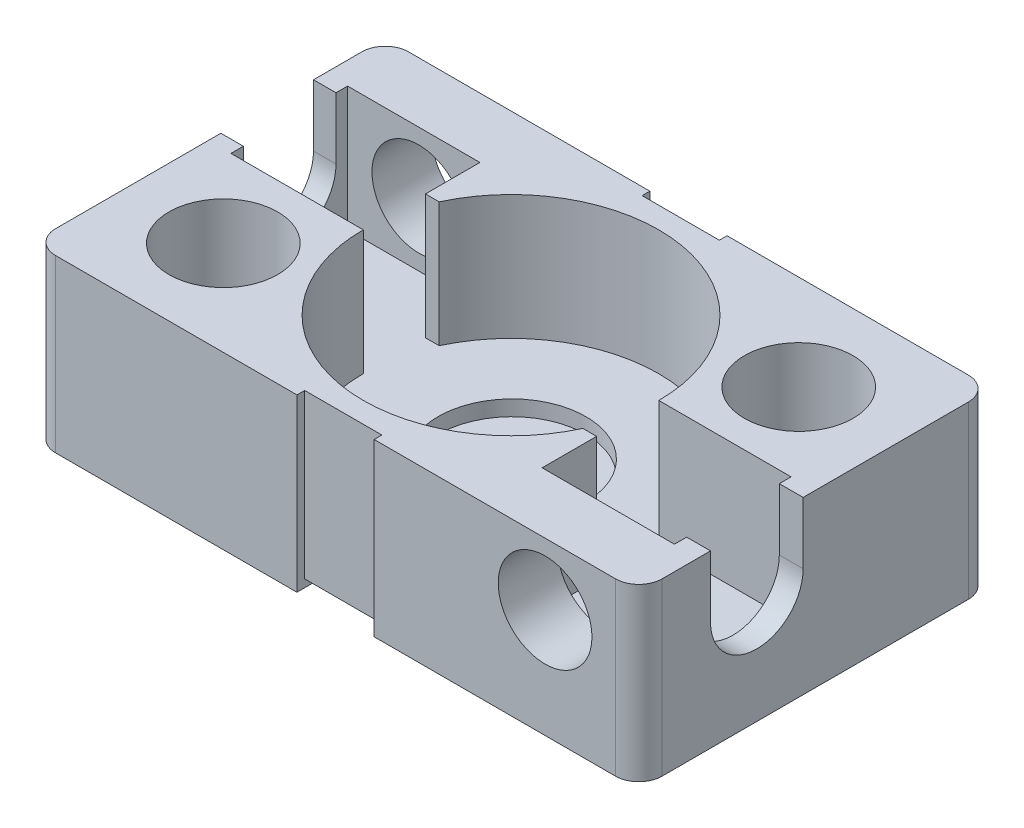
ISO-10303-21;
HEADER;
FILE_DESCRIPTION(('STEP AP214'),'2;1');
FILE_NAME('part.step','',(''),(''),'','','');
FILE_SCHEMA(('AUTOMOTIVE_DESIGN { 1 0 10303 214 1 1 1 1 }'));
ENDSEC;
DATA;
#1=APPLICATION_CONTEXT('core data for automotive mechanical design processes');
#2=APPLICATION_PROTOCOL_DEFINITION('international standard','automotive_design',2000,#1);
#3=PRODUCT_CONTEXT('',#1,'mechanical');
#4=PRODUCT('Part','Part','',(#3));
#5=PRODUCT_RELATED_PRODUCT_CATEGORY('part','',(#4));
#6=PRODUCT_DEFINITION_FORMATION('','',#4);
#7=PRODUCT_DEFINITION_CONTEXT('part definition',#1,'design');
#8=PRODUCT_DEFINITION('design','',#6,#7);
#9=PRODUCT_DEFINITION_SHAPE('','',#8);
#10=(LENGTH_UNIT() NAMED_UNIT(*) SI_UNIT(.MILLI.,.METRE.));
#11=(NAMED_UNIT(*) PLANE_ANGLE_UNIT() SI_UNIT($,.RADIAN.));
#12=(NAMED_UNIT(*) SI_UNIT($,.STERADIAN.) SOLID_ANGLE_UNIT());
#13=UNCERTAINTY_MEASURE_WITH_UNIT(LENGTH_MEASURE(1.E-05),#10,'distance_accuracy_value','');
#14=(GEOMETRIC_REPRESENTATION_CONTEXT(3) GLOBAL_UNCERTAINTY_ASSIGNED_CONTEXT((#13)) GLOBAL_UNIT_ASSIGNED_CONTEXT((#10,
#11,#12)) REPRESENTATION_CONTEXT('',''));
#15=CARTESIAN_POINT('',(0.,0.,0.));
#16=DIRECTION('',(0.,0.,1.));
#17=DIRECTION('',(1.,0.,0.));
#18=AXIS2_PLACEMENT_3D('',#15,#16,#17);
#19=CARTESIAN_POINT('',(-25.39,-15.5,16.));
#20=DIRECTION('',(0.,0.,1.));
#21=DIRECTION('',(1.,0.,0.));
#22=AXIS2_PLACEMENT_3D('',#19,#20,#21);
#23=PLANE('',#22);
#24=DIRECTION('',(0.,1.,0.));
#25=VECTOR('',#24,1.);
#26=CARTESIAN_POINT('',(-3.5,-15.5,16.));
#27=LINE('',#26,#25);
#28=CARTESIAN_POINT('',(-3.5,-15.5,16.));
#29=VERTEX_POINT('',#28);
#30=CARTESIAN_POINT('',(-3.5,0.,16.));
#31=VERTEX_POINT('',#30);
#32=EDGE_CURVE('E439',#29,#31,#27,.T.);
#33=ORIENTED_EDGE('',*,*,#32,.T.);
#34=DIRECTION('',(1.,0.,0.));
#35=VECTOR('',#34,1.);
#36=CARTESIAN_POINT('',(-25.39,0.,16.));
#37=LINE('',#36,#35);
#38=CARTESIAN_POINT('',(-25.39,0.,16.));
#39=VERTEX_POINT('',#38);
#40=EDGE_CURVE('E623',#39,#31,#37,.T.);
#41=ORIENTED_EDGE('',*,*,#40,.F.);
#42=DIRECTION('',(0.,1.,0.));
#43=VECTOR('',#42,1.);
#44=CARTESIAN_POINT('',(-25.39,-15.5,16.));
#45=LINE('',#44,#43);
#46=CARTESIAN_POINT('',(-25.39,-15.5,16.));
#47=VERTEX_POINT('',#46);
#48=EDGE_CURVE('E676',#47,#39,#45,.T.);
#49=ORIENTED_EDGE('',*,*,#48,.F.);
#50=DIRECTION('',(1.,0.,0.));
#51=VECTOR('',#50,1.);
#52=CARTESIAN_POINT('',(-25.39,-15.5,16.));
#53=LINE('',#52,#51);
#54=EDGE_CURVE('E642',#47,#29,#53,.T.);
#55=ORIENTED_EDGE('',*,*,#54,.T.);
#56=EDGE_LOOP('',(#33,#41,#49,#55));
#57=FACE_BOUND('',#56,.T.);
#58=ADVANCED_FACE('F113',(#57),#23,.T.);
#59=CARTESIAN_POINT('',(-25.39,-15.5,-16.));
#60=DIRECTION('',(0.,0.,-1.));
#61=DIRECTION('',(-1.,0.,0.));
#62=AXIS2_PLACEMENT_3D('',#59,#60,#61);
#63=PLANE('',#62);
#64=DIRECTION('',(0.,1.,0.));
#65=VECTOR('',#64,1.);
#66=CARTESIAN_POINT('',(3.5,-15.5,-16.));
#67=LINE('',#66,#65);
#68=CARTESIAN_POINT('',(3.5,-15.5,-16.));
#69=VERTEX_POINT('',#68);
#70=CARTESIAN_POINT('',(3.5,0.,-16.));
#71=VERTEX_POINT('',#70);
#72=EDGE_CURVE('E375',#69,#71,#67,.T.);
#73=ORIENTED_EDGE('',*,*,#72,.T.);
#74=DIRECTION('',(-1.,0.,0.));
#75=VECTOR('',#74,1.);
#76=CARTESIAN_POINT('',(-25.39,0.,-16.));
#77=LINE('',#76,#75);
#78=CARTESIAN_POINT('',(25.39,0.,-16.));
#79=VERTEX_POINT('',#78);
#80=EDGE_CURVE('E656',#79,#71,#77,.T.);
#81=ORIENTED_EDGE('',*,*,#80,.F.);
#82=DIRECTION('',(0.,1.,0.));
#83=VECTOR('',#82,1.);
#84=CARTESIAN_POINT('',(25.39,-15.5,-16.));
#85=LINE('',#84,#83);
#86=CARTESIAN_POINT('',(25.39,-15.5,-16.));
#87=VERTEX_POINT('',#86);
#88=EDGE_CURVE('E686',#87,#79,#85,.T.);
#89=ORIENTED_EDGE('',*,*,#88,.F.);
#90=DIRECTION('',(-1.,0.,0.));
#91=VECTOR('',#90,1.);
#92=CARTESIAN_POINT('',(-25.39,-15.5,-16.));
#93=LINE('',#92,#91);
#94=EDGE_CURVE('E630',#87,#69,#93,.T.);
#95=ORIENTED_EDGE('',*,*,#94,.T.);
#96=EDGE_LOOP('',(#73,#81,#89,#95));
#97=FACE_BOUND('',#96,.T.);
#98=ADVANCED_FACE('F755',(#97),#63,.T.);
#99=CARTESIAN_POINT('',(25.39,0.,13.89));
#100=DIRECTION('',(0.,-1.,0.));
#101=DIRECTION('',(0.,0.,-1.));
#102=AXIS2_PLACEMENT_3D('',#99,#100,#101);
#103=PLANE('',#102);
#104=CARTESIAN_POINT('',(-18.7489875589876,0.,7.42949377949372));
#105=DIRECTION('',(0.,1.,0.));
#106=DIRECTION('',(0.,0.,1.));
#107=AXIS2_PLACEMENT_3D('',#104,#105,#106);
#108=CIRCLE('',#107,4.93);
#109=CARTESIAN_POINT('',(-18.7489875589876,0.,12.3594937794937));
#110=VERTEX_POINT('',#109);
#111=EDGE_CURVE('E506',#110,#110,#108,.T.);
#112=ORIENTED_EDGE('',*,*,#111,.F.);
#113=EDGE_LOOP('',(#112));
#114=FACE_BOUND('',#113,.T.);
#115=ORIENTED_EDGE('',*,*,#40,.T.);
#116=DIRECTION('',(0.,0.,1.));
#117=VECTOR('',#116,1.);
#118=CARTESIAN_POINT('',(-3.5,0.,16.));
#119=LINE('',#118,#117);
#120=CARTESIAN_POINT('',(-3.5,0.,15.3));
#121=VERTEX_POINT('',#120);
#122=EDGE_CURVE('E429',#121,#31,#119,.T.);
#123=ORIENTED_EDGE('',*,*,#122,.F.);
#124=DIRECTION('',(-1.,0.,0.));
#125=VECTOR('',#124,1.);
#126=CARTESIAN_POINT('',(-3.5,0.,15.3));
#127=LINE('',#126,#125);
#128=CARTESIAN_POINT('',(3.5,0.,15.3));
#129=VERTEX_POINT('',#128);
#130=EDGE_CURVE('E435',#129,#121,#127,.T.);
#131=ORIENTED_EDGE('',*,*,#130,.F.);
#132=DIRECTION('',(0.,0.,-1.));
#133=VECTOR('',#132,1.);
#134=CARTESIAN_POINT('',(3.5,0.,15.3));
#135=LINE('',#134,#133);
#136=CARTESIAN_POINT('',(3.5,0.,16.));
#137=VERTEX_POINT('',#136);
#138=EDGE_CURVE('E424',#137,#129,#135,.T.);
#139=ORIENTED_EDGE('',*,*,#138,.F.);
#140=CARTESIAN_POINT('',(25.39,0.,16.));
#141=VERTEX_POINT('',#140);
#142=EDGE_CURVE('E669',#137,#141,#37,.T.);
#143=ORIENTED_EDGE('',*,*,#142,.T.);
#144=CARTESIAN_POINT('',(25.39,0.,13.89));
#145=DIRECTION('',(0.,1.,0.));
#146=DIRECTION('',(0.,0.,-1.));
#147=AXIS2_PLACEMENT_3D('',#144,#145,#146);
#148=CIRCLE('',#147,2.11);
#149=CARTESIAN_POINT('',(27.5,0.,13.89));
#150=VERTEX_POINT('',#149);
#151=EDGE_CURVE('E616',#141,#150,#148,.T.);
#152=ORIENTED_EDGE('',*,*,#151,.T.);
#153=DIRECTION('',(0.,0.,-1.));
#154=VECTOR('',#153,1.);
#155=CARTESIAN_POINT('',(27.5,0.,-13.89));
#156=LINE('',#155,#154);
#157=CARTESIAN_POINT('',(27.5,0.,9.49999999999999));
#158=VERTEX_POINT('',#157);
#159=EDGE_CURVE('E649',#150,#158,#156,.T.);
#160=ORIENTED_EDGE('',*,*,#159,.T.);
#161=DIRECTION('',(1.,0.,0.));
#162=VECTOR('',#161,1.);
#163=CARTESIAN_POINT('',(25.,0.,9.49999999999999));
#164=LINE('',#163,#162);
#165=CARTESIAN_POINT('',(25.3410124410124,0.,9.49999999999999));
#166=VERTEX_POINT('',#165);
#167=EDGE_CURVE('E470',#166,#158,#164,.T.);
#168=ORIENTED_EDGE('',*,*,#167,.F.);
#169=DIRECTION('',(0.,0.,-1.));
#170=VECTOR('',#169,1.);
#171=CARTESIAN_POINT('',(25.3410124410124,0.,0.));
#172=LINE('',#171,#170);
#173=CARTESIAN_POINT('',(25.3410124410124,0.,10.6094937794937));
#174=VERTEX_POINT('',#173);
#175=EDGE_CURVE('E559',#174,#166,#172,.T.);
#176=ORIENTED_EDGE('',*,*,#175,.F.);
#177=DIRECTION('',(1.,0.,0.));
#178=VECTOR('',#177,1.);
#179=CARTESIAN_POINT('',(-49.6353098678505,0.,10.6094937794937));
#180=LINE('',#179,#178);
#181=CARTESIAN_POINT('',(13.3410124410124,0.,10.6094937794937));
#182=VERTEX_POINT('',#181);
#183=EDGE_CURVE('E555',#182,#174,#180,.T.);
#184=ORIENTED_EDGE('',*,*,#183,.F.);
#185=DIRECTION('',(0.,0.,-1.));
#186=VECTOR('',#185,1.);
#187=CARTESIAN_POINT('',(13.3410124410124,0.,0.));
#188=LINE('',#187,#186);
#189=CARTESIAN_POINT('',(13.3410124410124,0.,5.66949377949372));
#190=VERTEX_POINT('',#189);
#191=EDGE_CURVE('E552',#182,#190,#188,.T.);
#192=ORIENTED_EDGE('',*,*,#191,.T.);
#193=DIRECTION('',(1.,0.,0.));
#194=VECTOR('',#193,1.);
#195=CARTESIAN_POINT('',(-49.6353098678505,0.,5.66949377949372));
#196=LINE('',#195,#194);
#197=CARTESIAN_POINT('',(12.0962746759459,0.,5.66949377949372));
#198=VERTEX_POINT('',#197);
#199=EDGE_CURVE('E512',#198,#190,#196,.T.);
#200=ORIENTED_EDGE('',*,*,#199,.F.);
#201=CARTESIAN_POINT('',(-0.0589875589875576,0.,0.0294937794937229));
#202=DIRECTION('',(0.,1.,0.));
#203=DIRECTION('',(0.,0.,1.));
#204=AXIS2_PLACEMENT_3D('',#201,#202,#203);
#205=CIRCLE('',#204,13.4);
#206=CARTESIAN_POINT('',(-13.4589875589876,0.,0.0294937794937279));
#207=VERTEX_POINT('',#206);
#208=EDGE_CURVE('E519',#207,#198,#205,.T.);
#209=ORIENTED_EDGE('',*,*,#208,.F.);
#210=DIRECTION('',(1.,0.,0.));
#211=VECTOR('',#210,1.);
#212=CARTESIAN_POINT('',(-49.6353098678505,0.,0.0294937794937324));
#213=LINE('',#212,#211);
#214=CARTESIAN_POINT('',(-25.4589875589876,0.,0.0294937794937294));
#215=VERTEX_POINT('',#214);
#216=EDGE_CURVE('E581',#215,#207,#213,.T.);
#217=ORIENTED_EDGE('',*,*,#216,.F.);
#218=DIRECTION('',(0.,0.,1.));
#219=VECTOR('',#218,1.);
#220=CARTESIAN_POINT('',(-25.4589875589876,0.,0.));
#221=LINE('',#220,#219);
#222=CARTESIAN_POINT('',(-25.4589875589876,0.,-1.1));
#223=VERTEX_POINT('',#222);
#224=EDGE_CURVE('E577',#223,#215,#221,.T.);
#225=ORIENTED_EDGE('',*,*,#224,.F.);
#226=DIRECTION('',(-1.,0.,0.));
#227=VECTOR('',#226,1.);
#228=CARTESIAN_POINT('',(-25.39,0.,-1.1));
#229=LINE('',#228,#227);
#230=CARTESIAN_POINT('',(-27.5,0.,-1.1));
#231=VERTEX_POINT('',#230);
#232=EDGE_CURVE('E488',#223,#231,#229,.T.);
#233=ORIENTED_EDGE('',*,*,#232,.T.);
#234=DIRECTION('',(0.,0.,1.));
#235=VECTOR('',#234,1.);
#236=CARTESIAN_POINT('',(-27.5,0.,-13.89));
#237=LINE('',#236,#235);
#238=CARTESIAN_POINT('',(-27.5,0.,13.89));
#239=VERTEX_POINT('',#238);
#240=EDGE_CURVE('E662',#231,#239,#237,.T.);
#241=ORIENTED_EDGE('',*,*,#240,.T.);
#242=CARTESIAN_POINT('',(-25.39,0.,13.89));
#243=DIRECTION('',(0.,1.,0.));
#244=DIRECTION('',(0.,0.,1.));
#245=AXIS2_PLACEMENT_3D('',#242,#243,#244);
#246=CIRCLE('',#245,2.11);
#247=EDGE_CURVE('E666',#239,#39,#246,.T.);
#248=ORIENTED_EDGE('',*,*,#247,.T.);
#249=EDGE_LOOP('',(#115,#123,#131,#139,#143,#152,#160,#168,#176,#184,#192,#200,#209,#217,#225,
#233,#241,#248));
#250=FACE_BOUND('',#249,.T.);
#251=ADVANCED_FACE('F732',(#114,#250),#103,.F.);
#252=CARTESIAN_POINT('',(27.5,-15.5,-13.89));
#253=DIRECTION('',(1.,0.,0.));
#254=DIRECTION('',(0.,0.,-1.));
#255=AXIS2_PLACEMENT_3D('',#252,#253,#254);
#256=PLANE('',#255);
#257=CARTESIAN_POINT('',(27.5,-5.6,5.29999999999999));
#258=DIRECTION('',(1.,0.,0.));
#259=DIRECTION('',(0.,0.,-1.));
#260=AXIS2_PLACEMENT_3D('',#257,#258,#259);
#261=CIRCLE('',#260,4.2);
#262=CARTESIAN_POINT('',(27.5,-5.6,9.49999999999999));
#263=VERTEX_POINT('',#262);
#264=CARTESIAN_POINT('',(27.5,-5.6,1.09999999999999));
#265=VERTEX_POINT('',#264);
#266=EDGE_CURVE('E465',#263,#265,#261,.T.);
#267=ORIENTED_EDGE('',*,*,#266,.F.);
#268=DIRECTION('',(0.,1.,0.));
#269=VECTOR('',#268,1.);
#270=CARTESIAN_POINT('',(27.5,-7.75,9.49999999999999));
#271=LINE('',#270,#269);
#272=EDGE_CURVE('E457',#263,#158,#271,.T.);
#273=ORIENTED_EDGE('',*,*,#272,.T.);
#274=ORIENTED_EDGE('',*,*,#159,.F.);
#275=DIRECTION('',(0.,1.,0.));
#276=VECTOR('',#275,1.);
#277=CARTESIAN_POINT('',(27.5,-15.5,13.89));
#278=LINE('',#277,#276);
#279=CARTESIAN_POINT('',(27.5,-15.5,13.89));
#280=VERTEX_POINT('',#279);
#281=EDGE_CURVE('E645',#280,#150,#278,.T.);
#282=ORIENTED_EDGE('',*,*,#281,.F.);
#283=DIRECTION('',(0.,0.,-1.));
#284=VECTOR('',#283,1.);
#285=CARTESIAN_POINT('',(27.5,-15.5,-13.89));
#286=LINE('',#285,#284);
#287=CARTESIAN_POINT('',(27.5,-15.5,-13.89));
#288=VERTEX_POINT('',#287);
#289=EDGE_CURVE('E622',#280,#288,#286,.T.);
#290=ORIENTED_EDGE('',*,*,#289,.T.);
#291=DIRECTION('',(0.,1.,0.));
#292=VECTOR('',#291,1.);
#293=CARTESIAN_POINT('',(27.5,-15.5,-13.89));
#294=LINE('',#293,#292);
#295=CARTESIAN_POINT('',(27.5,0.,-13.89));
#296=VERTEX_POINT('',#295);
#297=EDGE_CURVE('E688',#288,#296,#294,.T.);
#298=ORIENTED_EDGE('',*,*,#297,.T.);
#299=CARTESIAN_POINT('',(27.5,0.,1.09999999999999));
#300=VERTEX_POINT('',#299);
#301=EDGE_CURVE('E648',#300,#296,#156,.T.);
#302=ORIENTED_EDGE('',*,*,#301,.F.);
#303=DIRECTION('',(0.,1.,0.));
#304=VECTOR('',#303,1.);
#305=CARTESIAN_POINT('',(27.5,-7.75000000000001,1.09999999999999));
#306=LINE('',#305,#304);
#307=EDGE_CURVE('E467',#265,#300,#306,.T.);
#308=ORIENTED_EDGE('',*,*,#307,.F.);
#309=EDGE_LOOP('',(#267,#273,#274,#282,#290,#298,#302,#308));
#310=FACE_BOUND('',#309,.T.);
#311=ADVANCED_FACE('F740',(#310),#256,.T.);
#312=CARTESIAN_POINT('',(25.3410124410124,-11.3,0.));
#313=DIRECTION('',(1.,0.,0.));
#314=DIRECTION('',(0.,0.,-1.));
#315=AXIS2_PLACEMENT_3D('',#312,#313,#314);
#316=PLANE('',#315);
#317=DIRECTION('',(0.,1.,0.));
#318=VECTOR('',#317,1.);
#319=CARTESIAN_POINT('',(25.3410124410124,-11.3,9.49999999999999));
#320=LINE('',#319,#318);
#321=CARTESIAN_POINT('',(25.3410124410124,-5.6,9.49999999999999));
#322=VERTEX_POINT('',#321);
#323=EDGE_CURVE('E12',#322,#166,#320,.T.);
#324=ORIENTED_EDGE('',*,*,#323,.F.);
#325=CARTESIAN_POINT('',(25.3410124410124,-5.6,5.29999999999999));
#326=DIRECTION('',(1.,0.,0.));
#327=DIRECTION('',(0.,0.,-1.));
#328=AXIS2_PLACEMENT_3D('',#325,#326,#327);
#329=CIRCLE('',#328,4.2);
#330=CARTESIAN_POINT('',(25.3410124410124,-5.6,1.09999999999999));
#331=VERTEX_POINT('',#330);
#332=EDGE_CURVE('E701',#322,#331,#329,.T.);
#333=ORIENTED_EDGE('',*,*,#332,.T.);
#334=DIRECTION('',(0.,1.,0.));
#335=VECTOR('',#334,1.);
#336=CARTESIAN_POINT('',(25.3410124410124,-11.3,1.09999999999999));
#337=LINE('',#336,#335);
#338=CARTESIAN_POINT('',(25.3410124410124,0.,1.09999999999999));
#339=VERTEX_POINT('',#338);
#340=EDGE_CURVE('E121',#331,#339,#337,.T.);
#341=ORIENTED_EDGE('',*,*,#340,.T.);
#342=CARTESIAN_POINT('',(25.3410124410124,0.,0.0294937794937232));
#343=VERTEX_POINT('',#342);
#344=EDGE_CURVE('E558',#339,#343,#172,.T.);
#345=ORIENTED_EDGE('',*,*,#344,.T.);
#346=DIRECTION('',(0.,1.,0.));
#347=VECTOR('',#346,1.);
#348=CARTESIAN_POINT('',(25.3410124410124,-11.3,0.0294937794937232));
#349=LINE('',#348,#347);
#350=CARTESIAN_POINT('',(25.3410124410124,-11.3,0.0294937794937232));
#351=VERTEX_POINT('',#350);
#352=EDGE_CURVE('E604',#351,#343,#349,.T.);
#353=ORIENTED_EDGE('',*,*,#352,.F.);
#354=DIRECTION('',(0.,0.,-1.));
#355=VECTOR('',#354,1.);
#356=CARTESIAN_POINT('',(25.3410124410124,-11.3,0.));
#357=LINE('',#356,#355);
#358=CARTESIAN_POINT('',(25.3410124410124,-11.3,10.6094937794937));
#359=VERTEX_POINT('',#358);
#360=EDGE_CURVE('E524',#359,#351,#357,.T.);
#361=ORIENTED_EDGE('',*,*,#360,.F.);
#362=DIRECTION('',(0.,1.,0.));
#363=VECTOR('',#362,1.);
#364=CARTESIAN_POINT('',(25.3410124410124,-11.3,10.6094937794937));
#365=LINE('',#364,#363);
#366=EDGE_CURVE('E607',#359,#174,#365,.T.);
#367=ORIENTED_EDGE('',*,*,#366,.T.);
#368=ORIENTED_EDGE('',*,*,#175,.T.);
#369=EDGE_LOOP('',(#324,#333,#341,#345,#353,#361,#367,#368));
#370=FACE_BOUND('',#369,.T.);
#371=ADVANCED_FACE('F707',(#370),#316,.F.);
#372=CARTESIAN_POINT('',(-27.5,-15.5,-13.89));
#373=DIRECTION('',(-1.,0.,0.));
#374=DIRECTION('',(0.,0.,1.));
#375=AXIS2_PLACEMENT_3D('',#372,#373,#374);
#376=PLANE('',#375);
#377=CARTESIAN_POINT('',(-27.5,-5.6,-5.3));
#378=DIRECTION('',(-1.,0.,0.));
#379=DIRECTION('',(0.,0.,1.));
#380=AXIS2_PLACEMENT_3D('',#377,#378,#379);
#381=CIRCLE('',#380,4.2);
#382=CARTESIAN_POINT('',(-27.5,-5.6,-9.5));
#383=VERTEX_POINT('',#382);
#384=CARTESIAN_POINT('',(-27.5,-5.6,-1.1));
#385=VERTEX_POINT('',#384);
#386=EDGE_CURVE('E480',#383,#385,#381,.T.);
#387=ORIENTED_EDGE('',*,*,#386,.F.);
#388=DIRECTION('',(0.,1.,0.));
#389=VECTOR('',#388,1.);
#390=CARTESIAN_POINT('',(-27.5,-32.6350454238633,-9.5));
#391=LINE('',#390,#389);
#392=CARTESIAN_POINT('',(-27.5,0.,-9.5));
#393=VERTEX_POINT('',#392);
#394=EDGE_CURVE('E472',#383,#393,#391,.T.);
#395=ORIENTED_EDGE('',*,*,#394,.T.);
#396=CARTESIAN_POINT('',(-27.5,0.,-13.89));
#397=VERTEX_POINT('',#396);
#398=EDGE_CURVE('E663',#397,#393,#237,.T.);
#399=ORIENTED_EDGE('',*,*,#398,.F.);
#400=DIRECTION('',(0.,1.,0.));
#401=VECTOR('',#400,1.);
#402=CARTESIAN_POINT('',(-27.5,-15.5,-13.89));
#403=LINE('',#402,#401);
#404=CARTESIAN_POINT('',(-27.5,-15.5,-13.89));
#405=VERTEX_POINT('',#404);
#406=EDGE_CURVE('E681',#405,#397,#403,.T.);
#407=ORIENTED_EDGE('',*,*,#406,.F.);
#408=DIRECTION('',(0.,0.,1.));
#409=VECTOR('',#408,1.);
#410=CARTESIAN_POINT('',(-27.5,-15.5,-13.89));
#411=LINE('',#410,#409);
#412=CARTESIAN_POINT('',(-27.5,-15.5,13.89));
#413=VERTEX_POINT('',#412);
#414=EDGE_CURVE('E635',#405,#413,#411,.T.);
#415=ORIENTED_EDGE('',*,*,#414,.T.);
#416=DIRECTION('',(0.,1.,0.));
#417=VECTOR('',#416,1.);
#418=CARTESIAN_POINT('',(-27.5,-15.5,13.89));
#419=LINE('',#418,#417);
#420=EDGE_CURVE('E678',#413,#239,#419,.T.);
#421=ORIENTED_EDGE('',*,*,#420,.T.);
#422=ORIENTED_EDGE('',*,*,#240,.F.);
#423=DIRECTION('',(0.,1.,0.));
#424=VECTOR('',#423,1.);
#425=CARTESIAN_POINT('',(-27.5,-32.6350454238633,-1.09999999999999));
#426=LINE('',#425,#424);
#427=EDGE_CURVE('E482',#385,#231,#426,.T.);
#428=ORIENTED_EDGE('',*,*,#427,.F.);
#429=EDGE_LOOP('',(#387,#395,#399,#407,#415,#421,#422,#428));
#430=FACE_BOUND('',#429,.T.);
#431=ADVANCED_FACE('F850',(#430),#376,.T.);
#432=CARTESIAN_POINT('',(18.6310124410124,0.,-7.37050622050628));
#433=DIRECTION('',(0.,1.,0.));
#434=DIRECTION('',(0.,0.,1.));
#435=AXIS2_PLACEMENT_3D('',#432,#433,#434);
#436=CIRCLE('',#435,4.93);
#437=CARTESIAN_POINT('',(18.6310124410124,0.,-2.44050622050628));
#438=VERTEX_POINT('',#437);
#439=EDGE_CURVE('E588',#438,#438,#436,.T.);
#440=ORIENTED_EDGE('',*,*,#439,.F.);
#441=EDGE_LOOP('',(#440));
#442=FACE_BOUND('',#441,.T.);
#443=ORIENTED_EDGE('',*,*,#80,.T.);
#444=DIRECTION('',(0.,0.,-1.));
#445=VECTOR('',#444,1.);
#446=CARTESIAN_POINT('',(3.5,0.,-15.3));
#447=LINE('',#446,#445);
#448=CARTESIAN_POINT('',(3.5,0.,-15.3));
#449=VERTEX_POINT('',#448);
#450=EDGE_CURVE('E448',#449,#71,#447,.T.);
#451=ORIENTED_EDGE('',*,*,#450,.F.);
#452=DIRECTION('',(1.,0.,0.));
#453=VECTOR('',#452,1.);
#454=CARTESIAN_POINT('',(-3.5,0.,-15.3));
#455=LINE('',#454,#453);
#456=CARTESIAN_POINT('',(-3.5,0.,-15.3));
#457=VERTEX_POINT('',#456);
#458=EDGE_CURVE('E452',#457,#449,#455,.T.);
#459=ORIENTED_EDGE('',*,*,#458,.F.);
#460=DIRECTION('',(0.,0.,1.));
#461=VECTOR('',#460,1.);
#462=CARTESIAN_POINT('',(-3.5,0.,-16.));
#463=LINE('',#462,#461);
#464=CARTESIAN_POINT('',(-3.5,0.,-16.));
#465=VERTEX_POINT('',#464);
#466=EDGE_CURVE('E442',#465,#457,#463,.T.);
#467=ORIENTED_EDGE('',*,*,#466,.F.);
#468=CARTESIAN_POINT('',(-25.39,0.,-16.));
#469=VERTEX_POINT('',#468);
#470=EDGE_CURVE('E655',#465,#469,#77,.T.);
#471=ORIENTED_EDGE('',*,*,#470,.T.);
#472=CARTESIAN_POINT('',(-25.39,0.,-13.89));
#473=DIRECTION('',(0.,1.,0.));
#474=DIRECTION('',(0.,0.,-1.));
#475=AXIS2_PLACEMENT_3D('',#472,#473,#474);
#476=CIRCLE('',#475,2.11);
#477=EDGE_CURVE('E659',#469,#397,#476,.T.);
#478=ORIENTED_EDGE('',*,*,#477,.T.);
#479=ORIENTED_EDGE('',*,*,#398,.T.);
#480=DIRECTION('',(-1.,0.,0.));
#481=VECTOR('',#480,1.);
#482=CARTESIAN_POINT('',(-25.39,0.,-9.5));
#483=LINE('',#482,#481);
#484=CARTESIAN_POINT('',(-25.4589875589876,0.,-9.5));
#485=VERTEX_POINT('',#484);
#486=EDGE_CURVE('E485',#485,#393,#483,.T.);
#487=ORIENTED_EDGE('',*,*,#486,.F.);
#488=CARTESIAN_POINT('',(-25.4589875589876,0.,-10.5505062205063));
#489=VERTEX_POINT('',#488);
#490=EDGE_CURVE('E578',#489,#485,#221,.T.);
#491=ORIENTED_EDGE('',*,*,#490,.F.);
#492=DIRECTION('',(-1.,0.,0.));
#493=VECTOR('',#492,1.);
#494=CARTESIAN_POINT('',(-49.6353098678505,0.,-10.5505062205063));
#495=LINE('',#494,#493);
#496=CARTESIAN_POINT('',(-13.4589875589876,0.,-10.5505062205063));
#497=VERTEX_POINT('',#496);
#498=EDGE_CURVE('E574',#497,#489,#495,.T.);
#499=ORIENTED_EDGE('',*,*,#498,.F.);
#500=DIRECTION('',(0.,0.,-1.));
#501=VECTOR('',#500,1.);
#502=CARTESIAN_POINT('',(-13.4589875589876,0.,0.));
#503=LINE('',#502,#501);
#504=CARTESIAN_POINT('',(-13.4589875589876,0.,-5.61050622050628));
#505=VERTEX_POINT('',#504);
#506=EDGE_CURVE('E571',#505,#497,#503,.T.);
#507=ORIENTED_EDGE('',*,*,#506,.F.);
#508=DIRECTION('',(-1.,0.,0.));
#509=VECTOR('',#508,1.);
#510=CARTESIAN_POINT('',(-49.6353098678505,0.,-5.61050622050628));
#511=LINE('',#510,#509);
#512=CARTESIAN_POINT('',(-12.214249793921,0.,-5.61050622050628));
#513=VERTEX_POINT('',#512);
#514=EDGE_CURVE('E568',#513,#505,#511,.T.);
#515=ORIENTED_EDGE('',*,*,#514,.F.);
#516=CARTESIAN_POINT('',(-0.0589875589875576,0.,0.0294937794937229));
#517=DIRECTION('',(0.,1.,0.));
#518=DIRECTION('',(0.,0.,1.));
#519=AXIS2_PLACEMENT_3D('',#516,#517,#518);
#520=CIRCLE('',#519,13.4);
#521=CARTESIAN_POINT('',(13.3410124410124,0.,0.0294937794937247));
#522=VERTEX_POINT('',#521);
#523=EDGE_CURVE('E565',#522,#513,#520,.T.);
#524=ORIENTED_EDGE('',*,*,#523,.F.);
#525=DIRECTION('',(1.,0.,0.));
#526=VECTOR('',#525,1.);
#527=CARTESIAN_POINT('',(-49.6353098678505,0.,0.0294937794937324));
#528=LINE('',#527,#526);
#529=EDGE_CURVE('E562',#522,#343,#528,.T.);
#530=ORIENTED_EDGE('',*,*,#529,.T.);
#531=ORIENTED_EDGE('',*,*,#344,.F.);
#532=DIRECTION('',(1.,0.,0.));
#533=VECTOR('',#532,1.);
#534=CARTESIAN_POINT('',(25.,0.,1.09999999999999));
#535=LINE('',#534,#533);
#536=EDGE_CURVE('E473',#339,#300,#535,.T.);
#537=ORIENTED_EDGE('',*,*,#536,.T.);
#538=ORIENTED_EDGE('',*,*,#301,.T.);
#539=CARTESIAN_POINT('',(25.39,0.,-13.89));
#540=DIRECTION('',(0.,1.,0.));
#541=DIRECTION('',(0.,0.,-1.));
#542=AXIS2_PLACEMENT_3D('',#539,#540,#541);
#543=CIRCLE('',#542,2.11);
#544=EDGE_CURVE('E652',#296,#79,#543,.T.);
#545=ORIENTED_EDGE('',*,*,#544,.T.);
#546=EDGE_LOOP('',(#443,#451,#459,#467,#471,#478,#479,#487,#491,#499,#507,#515,#524,#530,#531,
#537,#538,#545));
#547=FACE_BOUND('',#546,.T.);
#548=ADVANCED_FACE('F711',(#442,#547),#103,.F.);
#549=CARTESIAN_POINT('',(-25.4589875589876,-11.3,0.));
#550=DIRECTION('',(-1.,0.,0.));
#551=DIRECTION('',(0.,0.,1.));
#552=AXIS2_PLACEMENT_3D('',#549,#550,#551);
#553=PLANE('',#552);
#554=DIRECTION('',(0.,1.,0.));
#555=VECTOR('',#554,1.);
#556=CARTESIAN_POINT('',(-25.4589875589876,-11.3,-9.5));
#557=LINE('',#556,#555);
#558=CARTESIAN_POINT('',(-25.4589875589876,-5.6,-9.5));
#559=VERTEX_POINT('',#558);
#560=EDGE_CURVE('E699',#559,#485,#557,.T.);
#561=ORIENTED_EDGE('',*,*,#560,.F.);
#562=CARTESIAN_POINT('',(-25.4589875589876,-5.6,-5.3));
#563=DIRECTION('',(-1.,0.,0.));
#564=DIRECTION('',(0.,0.,1.));
#565=AXIS2_PLACEMENT_3D('',#562,#563,#564);
#566=CIRCLE('',#565,4.2);
#567=CARTESIAN_POINT('',(-25.4589875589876,-5.6,-1.1));
#568=VERTEX_POINT('',#567);
#569=EDGE_CURVE('E675',#559,#568,#566,.T.);
#570=ORIENTED_EDGE('',*,*,#569,.T.);
#571=DIRECTION('',(0.,1.,0.));
#572=VECTOR('',#571,1.);
#573=CARTESIAN_POINT('',(-25.4589875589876,-11.3,-1.09999999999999));
#574=LINE('',#573,#572);
#575=EDGE_CURVE('E696',#568,#223,#574,.T.);
#576=ORIENTED_EDGE('',*,*,#575,.T.);
#577=ORIENTED_EDGE('',*,*,#224,.T.);
#578=DIRECTION('',(0.,1.,0.));
#579=VECTOR('',#578,1.);
#580=CARTESIAN_POINT('',(-25.4589875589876,-11.3,0.0294937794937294));
#581=LINE('',#580,#579);
#582=CARTESIAN_POINT('',(-25.4589875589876,-11.3,0.0294937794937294));
#583=VERTEX_POINT('',#582);
#584=EDGE_CURVE('E591',#583,#215,#581,.T.);
#585=ORIENTED_EDGE('',*,*,#584,.F.);
#586=DIRECTION('',(0.,0.,1.));
#587=VECTOR('',#586,1.);
#588=CARTESIAN_POINT('',(-25.4589875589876,-11.3,0.));
#589=LINE('',#588,#587);
#590=CARTESIAN_POINT('',(-25.4589875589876,-11.3,-10.5505062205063));
#591=VERTEX_POINT('',#590);
#592=EDGE_CURVE('E541',#591,#583,#589,.T.);
#593=ORIENTED_EDGE('',*,*,#592,.F.);
#594=DIRECTION('',(0.,1.,0.));
#595=VECTOR('',#594,1.);
#596=CARTESIAN_POINT('',(-25.4589875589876,-11.3,-10.5505062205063));
#597=LINE('',#596,#595);
#598=EDGE_CURVE('E594',#591,#489,#597,.T.);
#599=ORIENTED_EDGE('',*,*,#598,.T.);
#600=ORIENTED_EDGE('',*,*,#490,.T.);
#601=EDGE_LOOP('',(#561,#570,#576,#577,#585,#593,#599,#600));
#602=FACE_BOUND('',#601,.T.);
#603=ADVANCED_FACE('F776',(#602),#553,.F.);
#604=CARTESIAN_POINT('',(25.39,-15.5,13.89));
#605=DIRECTION('',(0.,1.,0.));
#606=DIRECTION('',(0.,0.,1.));
#607=AXIS2_PLACEMENT_3D('',#604,#605,#606);
#608=CYLINDRICAL_SURFACE('',#607,2.11);
#609=ORIENTED_EDGE('',*,*,#151,.F.);
#610=DIRECTION('',(0.,1.,0.));
#611=VECTOR('',#610,1.);
#612=CARTESIAN_POINT('',(25.39,-15.5,16.));
#613=LINE('',#612,#611);
#614=CARTESIAN_POINT('',(25.39,-15.5,16.));
#615=VERTEX_POINT('',#614);
#616=EDGE_CURVE('E672',#615,#141,#613,.T.);
#617=ORIENTED_EDGE('',*,*,#616,.F.);
#618=CARTESIAN_POINT('',(25.39,-15.5,13.89));
#619=DIRECTION('',(0.,1.,0.));
#620=DIRECTION('',(0.,0.,-1.));
#621=AXIS2_PLACEMENT_3D('',#618,#619,#620);
#622=CIRCLE('',#621,2.11);
#623=EDGE_CURVE('E619',#615,#280,#622,.T.);
#624=ORIENTED_EDGE('',*,*,#623,.T.);
#625=ORIENTED_EDGE('',*,*,#281,.T.);
#626=EDGE_LOOP('',(#609,#617,#624,#625));
#627=FACE_BOUND('',#626,.T.);
#628=ADVANCED_FACE('F115',(#627),#608,.T.);
#629=DIRECTION('',(0.,1.,0.));
#630=VECTOR('',#629,1.);
#631=CARTESIAN_POINT('',(3.5,-15.5,16.));
#632=LINE('',#631,#630);
#633=CARTESIAN_POINT('',(3.5,-15.5,16.));
#634=VERTEX_POINT('',#633);
#635=EDGE_CURVE('E432',#634,#137,#632,.T.);
#636=ORIENTED_EDGE('',*,*,#635,.F.);
#637=EDGE_CURVE('E641',#634,#615,#53,.T.);
#638=ORIENTED_EDGE('',*,*,#637,.T.);
#639=ORIENTED_EDGE('',*,*,#616,.T.);
#640=ORIENTED_EDGE('',*,*,#142,.F.);
#641=EDGE_LOOP('',(#636,#638,#639,#640));
#642=FACE_BOUND('',#641,.T.);
#643=CARTESIAN_POINT('',(19.,-5.64,16.));
#644=DIRECTION('',(0.,0.,1.));
#645=DIRECTION('',(1.,0.,0.));
#646=AXIS2_PLACEMENT_3D('',#643,#644,#645);
#647=CIRCLE('',#646,4.25);
#648=CARTESIAN_POINT('',(23.25,-5.64,16.));
#649=VERTEX_POINT('',#648);
#650=EDGE_CURVE('E500',#649,#649,#647,.T.);
#651=ORIENTED_EDGE('',*,*,#650,.F.);
#652=EDGE_LOOP('',(#651));
#653=FACE_BOUND('',#652,.T.);
#654=ADVANCED_FACE('F758',(#642,#653),#23,.T.);
#655=CARTESIAN_POINT('',(-25.39,-15.5,13.89));
#656=DIRECTION('',(0.,1.,0.));
#657=DIRECTION('',(0.,0.,1.));
#658=AXIS2_PLACEMENT_3D('',#655,#656,#657);
#659=CYLINDRICAL_SURFACE('',#658,2.11);
#660=ORIENTED_EDGE('',*,*,#247,.F.);
#661=ORIENTED_EDGE('',*,*,#420,.F.);
#662=CARTESIAN_POINT('',(-25.39,-15.5,13.89));
#663=DIRECTION('',(0.,1.,0.));
#664=DIRECTION('',(0.,0.,1.));
#665=AXIS2_PLACEMENT_3D('',#662,#663,#664);
#666=CIRCLE('',#665,2.11);
#667=EDGE_CURVE('E638',#413,#47,#666,.T.);
#668=ORIENTED_EDGE('',*,*,#667,.T.);
#669=ORIENTED_EDGE('',*,*,#48,.T.);
#670=EDGE_LOOP('',(#660,#661,#668,#669));
#671=FACE_BOUND('',#670,.T.);
#672=ADVANCED_FACE('F768',(#671),#659,.T.);
#673=CARTESIAN_POINT('',(-25.39,-15.5,-13.89));
#674=DIRECTION('',(0.,1.,0.));
#675=DIRECTION('',(0.,0.,1.));
#676=AXIS2_PLACEMENT_3D('',#673,#674,#675);
#677=CYLINDRICAL_SURFACE('',#676,2.11);
#678=ORIENTED_EDGE('',*,*,#477,.F.);
#679=DIRECTION('',(0.,1.,0.));
#680=VECTOR('',#679,1.);
#681=CARTESIAN_POINT('',(-25.39,-15.5,-16.));
#682=LINE('',#681,#680);
#683=CARTESIAN_POINT('',(-25.39,-15.5,-16.));
#684=VERTEX_POINT('',#683);
#685=EDGE_CURVE('E683',#684,#469,#682,.T.);
#686=ORIENTED_EDGE('',*,*,#685,.F.);
#687=CARTESIAN_POINT('',(-25.39,-15.5,-13.89));
#688=DIRECTION('',(0.,1.,0.));
#689=DIRECTION('',(0.,0.,-1.));
#690=AXIS2_PLACEMENT_3D('',#687,#688,#689);
#691=CIRCLE('',#690,2.11);
#692=EDGE_CURVE('E632',#684,#405,#691,.T.);
#693=ORIENTED_EDGE('',*,*,#692,.T.);
#694=ORIENTED_EDGE('',*,*,#406,.T.);
#695=EDGE_LOOP('',(#678,#686,#693,#694));
#696=FACE_BOUND('',#695,.T.);
#697=ADVANCED_FACE('F774',(#696),#677,.T.);
#698=DIRECTION('',(0.,1.,0.));
#699=VECTOR('',#698,1.);
#700=CARTESIAN_POINT('',(-3.5,-15.5,-16.));
#701=LINE('',#700,#699);
#702=CARTESIAN_POINT('',(-3.5,-15.5,-16.));
#703=VERTEX_POINT('',#702);
#704=EDGE_CURVE('E380',#703,#465,#701,.T.);
#705=ORIENTED_EDGE('',*,*,#704,.F.);
#706=EDGE_CURVE('E629',#703,#684,#93,.T.);
#707=ORIENTED_EDGE('',*,*,#706,.T.);
#708=ORIENTED_EDGE('',*,*,#685,.T.);
#709=ORIENTED_EDGE('',*,*,#470,.F.);
#710=EDGE_LOOP('',(#705,#707,#708,#709));
#711=FACE_BOUND('',#710,.T.);
#712=CARTESIAN_POINT('',(-19.,-5.64,-16.));
#713=DIRECTION('',(0.,0.,-1.));
#714=DIRECTION('',(-1.,0.,0.));
#715=AXIS2_PLACEMENT_3D('',#712,#713,#714);
#716=CIRCLE('',#715,4.25);
#717=CARTESIAN_POINT('',(-23.25,-5.64,-16.));
#718=VERTEX_POINT('',#717);
#719=EDGE_CURVE('E487',#718,#718,#716,.T.);
#720=ORIENTED_EDGE('',*,*,#719,.F.);
#721=EDGE_LOOP('',(#720));
#722=FACE_BOUND('',#721,.T.);
#723=ADVANCED_FACE('F764',(#711,#722),#63,.T.);
#724=CARTESIAN_POINT('',(25.39,-15.5,-13.89));
#725=DIRECTION('',(0.,1.,0.));
#726=DIRECTION('',(0.,0.,1.));
#727=AXIS2_PLACEMENT_3D('',#724,#725,#726);
#728=CYLINDRICAL_SURFACE('',#727,2.11);
#729=ORIENTED_EDGE('',*,*,#544,.F.);
#730=ORIENTED_EDGE('',*,*,#297,.F.);
#731=CARTESIAN_POINT('',(25.39,-15.5,-13.89));
#732=DIRECTION('',(0.,1.,0.));
#733=DIRECTION('',(0.,0.,-1.));
#734=AXIS2_PLACEMENT_3D('',#731,#732,#733);
#735=CIRCLE('',#734,2.11);
#736=EDGE_CURVE('E626',#288,#87,#735,.T.);
#737=ORIENTED_EDGE('',*,*,#736,.T.);
#738=ORIENTED_EDGE('',*,*,#88,.T.);
#739=EDGE_LOOP('',(#729,#730,#737,#738));
#740=FACE_BOUND('',#739,.T.);
#741=ADVANCED_FACE('F869',(#740),#728,.T.);
#742=CARTESIAN_POINT('',(25.39,-15.5,13.89));
#743=DIRECTION('',(0.,-1.,0.));
#744=DIRECTION('',(0.,0.,-1.));
#745=AXIS2_PLACEMENT_3D('',#742,#743,#744);
#746=PLANE('',#745);
#747=DIRECTION('',(-1.,0.,0.));
#748=VECTOR('',#747,1.);
#749=CARTESIAN_POINT('',(-3.5,-15.5,-12.5));
#750=LINE('',#749,#748);
#751=CARTESIAN_POINT('',(3.5,-15.5,-12.5));
#752=VERTEX_POINT('',#751);
#753=CARTESIAN_POINT('',(-3.5,-15.5,-12.5));
#754=VERTEX_POINT('',#753);
#755=EDGE_CURVE('E387',#752,#754,#750,.T.);
#756=ORIENTED_EDGE('',*,*,#755,.F.);
#757=DIRECTION('',(0.,0.,-1.));
#758=VECTOR('',#757,1.);
#759=CARTESIAN_POINT('',(3.5,-15.5,-15.3));
#760=LINE('',#759,#758);
#761=EDGE_CURVE('E369',#752,#69,#760,.T.);
#762=ORIENTED_EDGE('',*,*,#761,.T.);
#763=ORIENTED_EDGE('',*,*,#94,.F.);
#764=ORIENTED_EDGE('',*,*,#736,.F.);
#765=ORIENTED_EDGE('',*,*,#289,.F.);
#766=ORIENTED_EDGE('',*,*,#623,.F.);
#767=ORIENTED_EDGE('',*,*,#637,.F.);
#768=DIRECTION('',(0.,0.,-1.));
#769=VECTOR('',#768,1.);
#770=CARTESIAN_POINT('',(3.5,-15.5,15.3));
#771=LINE('',#770,#769);
#772=CARTESIAN_POINT('',(3.5,-15.5,12.5));
#773=VERTEX_POINT('',#772);
#774=EDGE_CURVE('E426',#634,#773,#771,.T.);
#775=ORIENTED_EDGE('',*,*,#774,.T.);
#776=DIRECTION('',(1.,0.,0.));
#777=VECTOR('',#776,1.);
#778=CARTESIAN_POINT('',(-3.5,-15.5,12.5));
#779=LINE('',#778,#777);
#780=CARTESIAN_POINT('',(-3.5,-15.5,12.5));
#781=VERTEX_POINT('',#780);
#782=EDGE_CURVE('E410',#781,#773,#779,.T.);
#783=ORIENTED_EDGE('',*,*,#782,.F.);
#784=DIRECTION('',(0.,0.,1.));
#785=VECTOR('',#784,1.);
#786=CARTESIAN_POINT('',(-3.5,-15.5,16.));
#787=LINE('',#786,#785);
#788=EDGE_CURVE('E428',#781,#29,#787,.T.);
#789=ORIENTED_EDGE('',*,*,#788,.T.);
#790=ORIENTED_EDGE('',*,*,#54,.F.);
#791=ORIENTED_EDGE('',*,*,#667,.F.);
#792=ORIENTED_EDGE('',*,*,#414,.F.);
#793=ORIENTED_EDGE('',*,*,#692,.F.);
#794=ORIENTED_EDGE('',*,*,#706,.F.);
#795=DIRECTION('',(0.,0.,1.));
#796=VECTOR('',#795,1.);
#797=CARTESIAN_POINT('',(-3.5,-15.5,-16.));
#798=LINE('',#797,#796);
#799=EDGE_CURVE('E381',#703,#754,#798,.T.);
#800=ORIENTED_EDGE('',*,*,#799,.T.);
#801=EDGE_LOOP('',(#756,#762,#763,#764,#765,#766,#767,#775,#783,#789,#790,#791,#792,#793,#794,#800));
#802=FACE_BOUND('',#801,.T.);
#803=ADVANCED_FACE('F392',(#802),#746,.T.);
#804=CARTESIAN_POINT('',(18.6310124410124,-11.3,-7.37050622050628));
#805=DIRECTION('',(0.,1.,0.));
#806=DIRECTION('',(0.,0.,1.));
#807=AXIS2_PLACEMENT_3D('',#804,#805,#806);
#808=CYLINDRICAL_SURFACE('',#807,4.93);
#809=CARTESIAN_POINT('',(18.6310124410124,-11.3,-7.37050622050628));
#810=DIRECTION('',(0.,1.,0.));
#811=DIRECTION('',(0.,0.,1.));
#812=AXIS2_PLACEMENT_3D('',#809,#810,#811);
#813=CIRCLE('',#812,4.93);
#814=CARTESIAN_POINT('',(18.6310124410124,-11.3,-2.44050622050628));
#815=VERTEX_POINT('',#814);
#816=EDGE_CURVE('E613',#815,#815,#813,.T.);
#817=ORIENTED_EDGE('',*,*,#816,.F.);
#818=EDGE_LOOP('',(#817));
#819=FACE_BOUND('',#818,.T.);
#820=ORIENTED_EDGE('',*,*,#439,.T.);
#821=EDGE_LOOP('',(#820));
#822=FACE_BOUND('',#821,.T.);
#823=ADVANCED_FACE('F863',(#819,#822),#808,.F.);
#824=CARTESIAN_POINT('',(-49.6353098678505,-11.3,0.));
#825=DIRECTION('',(0.,1.,0.));
#826=DIRECTION('',(0.,0.,1.));
#827=AXIS2_PLACEMENT_3D('',#824,#825,#826);
#828=PLANE('',#827);
#829=ORIENTED_EDGE('',*,*,#816,.T.);
#830=EDGE_LOOP('',(#829));
#831=FACE_BOUND('',#830,.T.);
#832=ADVANCED_FACE('F859',(#831),#828,.T.);
#833=CARTESIAN_POINT('',(-49.6353098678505,-11.3,5.66949377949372));
#834=DIRECTION('',(0.,0.,1.));
#835=DIRECTION('',(1.,0.,0.));
#836=AXIS2_PLACEMENT_3D('',#833,#834,#835);
#837=PLANE('',#836);
#838=ORIENTED_EDGE('',*,*,#199,.T.);
#839=DIRECTION('',(0.,1.,0.));
#840=VECTOR('',#839,1.);
#841=CARTESIAN_POINT('',(13.3410124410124,-11.3,5.66949377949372));
#842=LINE('',#841,#840);
#843=CARTESIAN_POINT('',(13.3410124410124,-11.3,5.66949377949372));
#844=VERTEX_POINT('',#843);
#845=EDGE_CURVE('E550',#844,#190,#842,.T.);
#846=ORIENTED_EDGE('',*,*,#845,.F.);
#847=DIRECTION('',(1.,0.,0.));
#848=VECTOR('',#847,1.);
#849=CARTESIAN_POINT('',(-49.6353098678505,-11.3,5.66949377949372));
#850=LINE('',#849,#848);
#851=CARTESIAN_POINT('',(12.0962746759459,-11.3,5.66949377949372));
#852=VERTEX_POINT('',#851);
#853=EDGE_CURVE('E515',#852,#844,#850,.T.);
#854=ORIENTED_EDGE('',*,*,#853,.F.);
#855=DIRECTION('',(0.,1.,0.));
#856=VECTOR('',#855,1.);
#857=CARTESIAN_POINT('',(12.0962746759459,-11.3,5.66949377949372));
#858=LINE('',#857,#856);
#859=EDGE_CURVE('E586',#852,#198,#858,.T.);
#860=ORIENTED_EDGE('',*,*,#859,.T.);
#861=EDGE_LOOP('',(#838,#846,#854,#860));
#862=FACE_BOUND('',#861,.T.);
#863=ADVANCED_FACE('F822',(#862),#837,.F.);
#864=CARTESIAN_POINT('',(-0.0589875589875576,-11.3,0.0294937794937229));
#865=DIRECTION('',(0.,1.,0.));
#866=DIRECTION('',(0.,0.,1.));
#867=AXIS2_PLACEMENT_3D('',#864,#865,#866);
#868=CYLINDRICAL_SURFACE('',#867,13.4);
#869=ORIENTED_EDGE('',*,*,#208,.T.);
#870=ORIENTED_EDGE('',*,*,#859,.F.);
#871=CARTESIAN_POINT('',(-0.0589875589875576,-11.3,0.0294937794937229));
#872=DIRECTION('',(0.,1.,0.));
#873=DIRECTION('',(0.,0.,1.));
#874=AXIS2_PLACEMENT_3D('',#871,#872,#873);
#875=CIRCLE('',#874,13.4);
#876=CARTESIAN_POINT('',(-13.4589875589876,-11.3,0.0294937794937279));
#877=VERTEX_POINT('',#876);
#878=EDGE_CURVE('E547',#877,#852,#875,.T.);
#879=ORIENTED_EDGE('',*,*,#878,.F.);
#880=DIRECTION('',(0.,1.,0.));
#881=VECTOR('',#880,1.);
#882=CARTESIAN_POINT('',(-13.4589875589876,-11.3,0.0294937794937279));
#883=LINE('',#882,#881);
#884=EDGE_CURVE('E589',#877,#207,#883,.T.);
#885=ORIENTED_EDGE('',*,*,#884,.T.);
#886=EDGE_LOOP('',(#869,#870,#879,#885));
#887=FACE_BOUND('',#886,.T.);
#888=ADVANCED_FACE('F818',(#887),#868,.F.);
#889=CARTESIAN_POINT('',(-49.6353098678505,-11.3,0.0294937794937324));
#890=DIRECTION('',(0.,0.,1.));
#891=DIRECTION('',(1.,0.,0.));
#892=AXIS2_PLACEMENT_3D('',#889,#890,#891);
#893=PLANE('',#892);
#894=ORIENTED_EDGE('',*,*,#216,.T.);
#895=ORIENTED_EDGE('',*,*,#884,.F.);
#896=DIRECTION('',(1.,0.,0.));
#897=VECTOR('',#896,1.);
#898=CARTESIAN_POINT('',(-49.6353098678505,-11.3,0.0294937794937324));
#899=LINE('',#898,#897);
#900=EDGE_CURVE('E544',#583,#877,#899,.T.);
#901=ORIENTED_EDGE('',*,*,#900,.F.);
#902=ORIENTED_EDGE('',*,*,#584,.T.);
#903=EDGE_LOOP('',(#894,#895,#901,#902));
#904=FACE_BOUND('',#903,.T.);
#905=ADVANCED_FACE('F821',(#904),#893,.F.);
#906=CARTESIAN_POINT('',(-49.6353098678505,-11.3,-10.5505062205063));
#907=DIRECTION('',(0.,0.,-1.));
#908=DIRECTION('',(-1.,0.,0.));
#909=AXIS2_PLACEMENT_3D('',#906,#907,#908);
#910=PLANE('',#909);
#911=CARTESIAN_POINT('',(-19.,-5.64,-10.5505062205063));
#912=DIRECTION('',(0.,0.,-1.));
#913=DIRECTION('',(-1.,0.,0.));
#914=AXIS2_PLACEMENT_3D('',#911,#912,#913);
#915=CIRCLE('',#914,4.25);
#916=CARTESIAN_POINT('',(-23.25,-5.64,-10.5505062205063));
#917=VERTEX_POINT('',#916);
#918=EDGE_CURVE('E495',#917,#917,#915,.T.);
#919=ORIENTED_EDGE('',*,*,#918,.T.);
#920=EDGE_LOOP('',(#919));
#921=FACE_BOUND('',#920,.T.);
#922=ORIENTED_EDGE('',*,*,#498,.T.);
#923=ORIENTED_EDGE('',*,*,#598,.F.);
#924=DIRECTION('',(-1.,0.,0.));
#925=VECTOR('',#924,1.);
#926=CARTESIAN_POINT('',(-49.6353098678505,-11.3,-10.5505062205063));
#927=LINE('',#926,#925);
#928=CARTESIAN_POINT('',(-13.4589875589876,-11.3,-10.5505062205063));
#929=VERTEX_POINT('',#928);
#930=EDGE_CURVE('E538',#929,#591,#927,.T.);
#931=ORIENTED_EDGE('',*,*,#930,.F.);
#932=DIRECTION('',(0.,1.,0.));
#933=VECTOR('',#932,1.);
#934=CARTESIAN_POINT('',(-13.4589875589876,-11.3,-10.5505062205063));
#935=LINE('',#934,#933);
#936=EDGE_CURVE('E596',#929,#497,#935,.T.);
#937=ORIENTED_EDGE('',*,*,#936,.T.);
#938=EDGE_LOOP('',(#922,#923,#931,#937));
#939=FACE_BOUND('',#938,.T.);
#940=ADVANCED_FACE('F826',(#921,#939),#910,.F.);
#941=CARTESIAN_POINT('',(-13.4589875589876,-11.3,0.));
#942=DIRECTION('',(1.,0.,0.));
#943=DIRECTION('',(0.,0.,-1.));
#944=AXIS2_PLACEMENT_3D('',#941,#942,#943);
#945=PLANE('',#944);
#946=ORIENTED_EDGE('',*,*,#506,.T.);
#947=ORIENTED_EDGE('',*,*,#936,.F.);
#948=DIRECTION('',(0.,0.,-1.));
#949=VECTOR('',#948,1.);
#950=CARTESIAN_POINT('',(-13.4589875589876,-11.3,0.));
#951=LINE('',#950,#949);
#952=CARTESIAN_POINT('',(-13.4589875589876,-11.3,-5.61050622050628));
#953=VERTEX_POINT('',#952);
#954=EDGE_CURVE('E535',#953,#929,#951,.T.);
#955=ORIENTED_EDGE('',*,*,#954,.F.);
#956=DIRECTION('',(0.,1.,0.));
#957=VECTOR('',#956,1.);
#958=CARTESIAN_POINT('',(-13.4589875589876,-11.3,-5.61050622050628));
#959=LINE('',#958,#957);
#960=EDGE_CURVE('E598',#953,#505,#959,.T.);
#961=ORIENTED_EDGE('',*,*,#960,.T.);
#962=EDGE_LOOP('',(#946,#947,#955,#961));
#963=FACE_BOUND('',#962,.T.);
#964=ADVANCED_FACE('F833',(#963),#945,.F.);
#965=CARTESIAN_POINT('',(-49.6353098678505,-11.3,-5.61050622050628));
#966=DIRECTION('',(0.,0.,-1.));
#967=DIRECTION('',(-1.,0.,0.));
#968=AXIS2_PLACEMENT_3D('',#965,#966,#967);
#969=PLANE('',#968);
#970=ORIENTED_EDGE('',*,*,#514,.T.);
#971=ORIENTED_EDGE('',*,*,#960,.F.);
#972=DIRECTION('',(-1.,0.,0.));
#973=VECTOR('',#972,1.);
#974=CARTESIAN_POINT('',(-49.6353098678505,-11.3,-5.61050622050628));
#975=LINE('',#974,#973);
#976=CARTESIAN_POINT('',(-12.214249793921,-11.3,-5.61050622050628));
#977=VERTEX_POINT('',#976);
#978=EDGE_CURVE('E532',#977,#953,#975,.T.);
#979=ORIENTED_EDGE('',*,*,#978,.F.);
#980=DIRECTION('',(0.,1.,0.));
#981=VECTOR('',#980,1.);
#982=CARTESIAN_POINT('',(-12.214249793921,-11.3,-5.61050622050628));
#983=LINE('',#982,#981);
#984=EDGE_CURVE('E600',#977,#513,#983,.T.);
#985=ORIENTED_EDGE('',*,*,#984,.T.);
#986=EDGE_LOOP('',(#970,#971,#979,#985));
#987=FACE_BOUND('',#986,.T.);
#988=ADVANCED_FACE('F837',(#987),#969,.F.);
#989=CARTESIAN_POINT('',(-0.0589875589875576,-11.3,0.0294937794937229));
#990=DIRECTION('',(0.,1.,0.));
#991=DIRECTION('',(0.,0.,1.));
#992=AXIS2_PLACEMENT_3D('',#989,#990,#991);
#993=CYLINDRICAL_SURFACE('',#992,13.4);
#994=ORIENTED_EDGE('',*,*,#523,.T.);
#995=ORIENTED_EDGE('',*,*,#984,.F.);
#996=CARTESIAN_POINT('',(-0.0589875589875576,-11.3,0.0294937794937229));
#997=DIRECTION('',(0.,1.,0.));
#998=DIRECTION('',(0.,0.,1.));
#999=AXIS2_PLACEMENT_3D('',#996,#997,#998);
#1000=CIRCLE('',#999,13.4);
#1001=CARTESIAN_POINT('',(13.3410124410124,-11.3,0.0294937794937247));
#1002=VERTEX_POINT('',#1001);
#1003=EDGE_CURVE('E529',#1002,#977,#1000,.T.);
#1004=ORIENTED_EDGE('',*,*,#1003,.F.);
#1005=DIRECTION('',(0.,1.,0.));
#1006=VECTOR('',#1005,1.);
#1007=CARTESIAN_POINT('',(13.3410124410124,-11.3,0.0294937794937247));
#1008=LINE('',#1007,#1006);
#1009=EDGE_CURVE('E602',#1002,#522,#1008,.T.);
#1010=ORIENTED_EDGE('',*,*,#1009,.T.);
#1011=EDGE_LOOP('',(#994,#995,#1004,#1010));
#1012=FACE_BOUND('',#1011,.T.);
#1013=ADVANCED_FACE('F841',(#1012),#993,.F.);
#1014=CARTESIAN_POINT('',(-49.6353098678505,-11.3,0.0294937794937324));
#1015=DIRECTION('',(0.,0.,1.));
#1016=DIRECTION('',(1.,0.,0.));
#1017=AXIS2_PLACEMENT_3D('',#1014,#1015,#1016);
#1018=PLANE('',#1017);
#1019=ORIENTED_EDGE('',*,*,#529,.F.);
#1020=ORIENTED_EDGE('',*,*,#1009,.F.);
#1021=DIRECTION('',(1.,0.,0.));
#1022=VECTOR('',#1021,1.);
#1023=CARTESIAN_POINT('',(-49.6353098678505,-11.3,0.0294937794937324));
#1024=LINE('',#1023,#1022);
#1025=EDGE_CURVE('E527',#1002,#351,#1024,.T.);
#1026=ORIENTED_EDGE('',*,*,#1025,.T.);
#1027=ORIENTED_EDGE('',*,*,#352,.T.);
#1028=EDGE_LOOP('',(#1019,#1020,#1026,#1027));
#1029=FACE_BOUND('',#1028,.T.);
#1030=ADVANCED_FACE('F717',(#1029),#1018,.T.);
#1031=CARTESIAN_POINT('',(-49.6353098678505,-11.3,10.6094937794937));
#1032=DIRECTION('',(0.,0.,1.));
#1033=DIRECTION('',(1.,0.,0.));
#1034=AXIS2_PLACEMENT_3D('',#1031,#1032,#1033);
#1035=PLANE('',#1034);
#1036=CARTESIAN_POINT('',(19.,-5.64,10.6094937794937));
#1037=DIRECTION('',(0.,0.,1.));
#1038=DIRECTION('',(1.,0.,0.));
#1039=AXIS2_PLACEMENT_3D('',#1036,#1037,#1038);
#1040=CIRCLE('',#1039,4.25);
#1041=CARTESIAN_POINT('',(23.25,-5.64,10.6094937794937));
#1042=VERTEX_POINT('',#1041);
#1043=EDGE_CURVE('E496',#1042,#1042,#1040,.T.);
#1044=ORIENTED_EDGE('',*,*,#1043,.T.);
#1045=EDGE_LOOP('',(#1044));
#1046=FACE_BOUND('',#1045,.T.);
#1047=ORIENTED_EDGE('',*,*,#183,.T.);
#1048=ORIENTED_EDGE('',*,*,#366,.F.);
#1049=DIRECTION('',(1.,0.,0.));
#1050=VECTOR('',#1049,1.);
#1051=CARTESIAN_POINT('',(-49.6353098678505,-11.3,10.6094937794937));
#1052=LINE('',#1051,#1050);
#1053=CARTESIAN_POINT('',(13.3410124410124,-11.3,10.6094937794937));
#1054=VERTEX_POINT('',#1053);
#1055=EDGE_CURVE('E521',#1054,#359,#1052,.T.);
#1056=ORIENTED_EDGE('',*,*,#1055,.F.);
#1057=DIRECTION('',(0.,1.,0.));
#1058=VECTOR('',#1057,1.);
#1059=CARTESIAN_POINT('',(13.3410124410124,-11.3,10.6094937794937));
#1060=LINE('',#1059,#1058);
#1061=EDGE_CURVE('E609',#1054,#182,#1060,.T.);
#1062=ORIENTED_EDGE('',*,*,#1061,.T.);
#1063=EDGE_LOOP('',(#1047,#1048,#1056,#1062));
#1064=FACE_BOUND('',#1063,.T.);
#1065=ADVANCED_FACE('F726',(#1046,#1064),#1035,.F.);
#1066=CARTESIAN_POINT('',(13.3410124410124,-11.3,0.));
#1067=DIRECTION('',(1.,0.,0.));
#1068=DIRECTION('',(0.,0.,-1.));
#1069=AXIS2_PLACEMENT_3D('',#1066,#1067,#1068);
#1070=PLANE('',#1069);
#1071=ORIENTED_EDGE('',*,*,#191,.F.);
#1072=ORIENTED_EDGE('',*,*,#1061,.F.);
#1073=DIRECTION('',(0.,0.,-1.));
#1074=VECTOR('',#1073,1.);
#1075=CARTESIAN_POINT('',(13.3410124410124,-11.3,0.));
#1076=LINE('',#1075,#1074);
#1077=EDGE_CURVE('E518',#1054,#844,#1076,.T.);
#1078=ORIENTED_EDGE('',*,*,#1077,.T.);
#1079=ORIENTED_EDGE('',*,*,#845,.T.);
#1080=EDGE_LOOP('',(#1071,#1072,#1078,#1079));
#1081=FACE_BOUND('',#1080,.T.);
#1082=ADVANCED_FACE('F816',(#1081),#1070,.T.);
#1083=CARTESIAN_POINT('',(-49.6353098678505,-11.3,0.));
#1084=DIRECTION('',(0.,1.,0.));
#1085=DIRECTION('',(0.,0.,1.));
#1086=AXIS2_PLACEMENT_3D('',#1083,#1084,#1085);
#1087=PLANE('',#1086);
#1088=CARTESIAN_POINT('',(0.,-11.3,0.));
#1089=DIRECTION('',(0.,1.,0.));
#1090=DIRECTION('',(0.,0.,1.));
#1091=AXIS2_PLACEMENT_3D('',#1088,#1089,#1090);
#1092=CIRCLE('',#1091,6.7);
#1093=CARTESIAN_POINT('',(0.,-11.3,6.7));
#1094=VERTEX_POINT('',#1093);
#1095=EDGE_CURVE('E499',#1094,#1094,#1092,.T.);
#1096=ORIENTED_EDGE('',*,*,#1095,.F.);
#1097=EDGE_LOOP('',(#1096));
#1098=FACE_BOUND('',#1097,.T.);
#1099=ORIENTED_EDGE('',*,*,#853,.T.);
#1100=ORIENTED_EDGE('',*,*,#1077,.F.);
#1101=ORIENTED_EDGE('',*,*,#1055,.T.);
#1102=ORIENTED_EDGE('',*,*,#360,.T.);
#1103=ORIENTED_EDGE('',*,*,#1025,.F.);
#1104=ORIENTED_EDGE('',*,*,#1003,.T.);
#1105=ORIENTED_EDGE('',*,*,#978,.T.);
#1106=ORIENTED_EDGE('',*,*,#954,.T.);
#1107=ORIENTED_EDGE('',*,*,#930,.T.);
#1108=ORIENTED_EDGE('',*,*,#592,.T.);
#1109=ORIENTED_EDGE('',*,*,#900,.T.);
#1110=ORIENTED_EDGE('',*,*,#878,.T.);
#1111=EDGE_LOOP('',(#1099,#1100,#1101,#1102,#1103,#1104,#1105,#1106,#1107,#1108,#1109,#1110));
#1112=FACE_BOUND('',#1111,.T.);
#1113=ADVANCED_FACE('F721',(#1098,#1112),#1087,.T.);
#1114=CARTESIAN_POINT('',(-18.7489875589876,-11.3,7.42949377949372));
#1115=DIRECTION('',(0.,1.,0.));
#1116=DIRECTION('',(0.,0.,1.));
#1117=AXIS2_PLACEMENT_3D('',#1114,#1115,#1116);
#1118=CYLINDRICAL_SURFACE('',#1117,4.93);
#1119=CARTESIAN_POINT('',(-18.7489875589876,-11.3,7.42949377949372));
#1120=DIRECTION('',(0.,1.,0.));
#1121=DIRECTION('',(0.,0.,1.));
#1122=AXIS2_PLACEMENT_3D('',#1119,#1120,#1121);
#1123=CIRCLE('',#1122,4.93);
#1124=CARTESIAN_POINT('',(-18.7489875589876,-11.3,12.3594937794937));
#1125=VERTEX_POINT('',#1124);
#1126=EDGE_CURVE('E509',#1125,#1125,#1123,.T.);
#1127=ORIENTED_EDGE('',*,*,#1126,.F.);
#1128=EDGE_LOOP('',(#1127));
#1129=FACE_BOUND('',#1128,.T.);
#1130=ORIENTED_EDGE('',*,*,#111,.T.);
#1131=EDGE_LOOP('',(#1130));
#1132=FACE_BOUND('',#1131,.T.);
#1133=ADVANCED_FACE('F809',(#1129,#1132),#1118,.F.);
#1134=CARTESIAN_POINT('',(-49.6353098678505,-11.3,0.));
#1135=DIRECTION('',(0.,1.,0.));
#1136=DIRECTION('',(0.,0.,1.));
#1137=AXIS2_PLACEMENT_3D('',#1134,#1135,#1136);
#1138=PLANE('',#1137);
#1139=ORIENTED_EDGE('',*,*,#1126,.T.);
#1140=EDGE_LOOP('',(#1139));
#1141=FACE_BOUND('',#1140,.T.);
#1142=ADVANCED_FACE('F805',(#1141),#1138,.T.);
#1143=CARTESIAN_POINT('',(0.,-12.7,0.));
#1144=DIRECTION('',(0.,1.,0.));
#1145=DIRECTION('',(0.,0.,1.));
#1146=AXIS2_PLACEMENT_3D('',#1143,#1144,#1145);
#1147=CYLINDRICAL_SURFACE('',#1146,6.7);
#1148=CARTESIAN_POINT('',(0.,-12.7,0.));
#1149=DIRECTION('',(0.,1.,0.));
#1150=DIRECTION('',(0.,0.,1.));
#1151=AXIS2_PLACEMENT_3D('',#1148,#1149,#1150);
#1152=CIRCLE('',#1151,6.7);
#1153=CARTESIAN_POINT('',(0.,-12.7,6.7));
#1154=VERTEX_POINT('',#1153);
#1155=EDGE_CURVE('E503',#1154,#1154,#1152,.T.);
#1156=ORIENTED_EDGE('',*,*,#1155,.F.);
#1157=EDGE_LOOP('',(#1156));
#1158=FACE_BOUND('',#1157,.T.);
#1159=ORIENTED_EDGE('',*,*,#1095,.T.);
#1160=EDGE_LOOP('',(#1159));
#1161=FACE_BOUND('',#1160,.T.);
#1162=ADVANCED_FACE('F797',(#1158,#1161),#1147,.F.);
#1163=CARTESIAN_POINT('',(0.,-12.7,0.));
#1164=DIRECTION('',(0.,1.,0.));
#1165=DIRECTION('',(0.,0.,1.));
#1166=AXIS2_PLACEMENT_3D('',#1163,#1164,#1165);
#1167=PLANE('',#1166);
#1168=ORIENTED_EDGE('',*,*,#1155,.T.);
#1169=EDGE_LOOP('',(#1168));
#1170=FACE_BOUND('',#1169,.T.);
#1171=ADVANCED_FACE('F787',(#1170),#1167,.T.);
#1172=CARTESIAN_POINT('',(19.,-5.64,10.6094937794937));
#1173=DIRECTION('',(0.,0.,1.));
#1174=DIRECTION('',(1.,0.,0.));
#1175=AXIS2_PLACEMENT_3D('',#1172,#1173,#1174);
#1176=CYLINDRICAL_SURFACE('',#1175,4.25);
#1177=ORIENTED_EDGE('',*,*,#1043,.F.);
#1178=EDGE_LOOP('',(#1177));
#1179=FACE_BOUND('',#1178,.T.);
#1180=ORIENTED_EDGE('',*,*,#650,.T.);
#1181=EDGE_LOOP('',(#1180));
#1182=FACE_BOUND('',#1181,.T.);
#1183=ADVANCED_FACE('F784',(#1179,#1182),#1176,.F.);
#1184=CARTESIAN_POINT('',(-19.,-5.64,-8.6));
#1185=DIRECTION('',(0.,0.,-1.));
#1186=DIRECTION('',(-1.,0.,0.));
#1187=AXIS2_PLACEMENT_3D('',#1184,#1185,#1186);
#1188=CYLINDRICAL_SURFACE('',#1187,4.25);
#1189=ORIENTED_EDGE('',*,*,#719,.T.);
#1190=EDGE_LOOP('',(#1189));
#1191=FACE_BOUND('',#1190,.T.);
#1192=ORIENTED_EDGE('',*,*,#918,.F.);
#1193=EDGE_LOOP('',(#1192));
#1194=FACE_BOUND('',#1193,.T.);
#1195=ADVANCED_FACE('F786',(#1191,#1194),#1188,.F.);
#1196=CARTESIAN_POINT('',(-25.39,-32.6350454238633,-9.5));
#1197=DIRECTION('',(0.,0.,1.));
#1198=DIRECTION('',(1.,0.,0.));
#1199=AXIS2_PLACEMENT_3D('',#1196,#1197,#1198);
#1200=PLANE('',#1199);
#1201=ORIENTED_EDGE('',*,*,#560,.T.);
#1202=ORIENTED_EDGE('',*,*,#486,.T.);
#1203=ORIENTED_EDGE('',*,*,#394,.F.);
#1204=DIRECTION('',(-1.,0.,0.));
#1205=VECTOR('',#1204,1.);
#1206=CARTESIAN_POINT('',(-25.39,-5.6,-9.5));
#1207=LINE('',#1206,#1205);
#1208=EDGE_CURVE('E484',#559,#383,#1207,.T.);
#1209=ORIENTED_EDGE('',*,*,#1208,.F.);
#1210=EDGE_LOOP('',(#1201,#1202,#1203,#1209));
#1211=FACE_BOUND('',#1210,.T.);
#1212=ADVANCED_FACE('F794',(#1211),#1200,.T.);
#1213=CARTESIAN_POINT('',(-25.39,-32.6350454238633,-1.09999999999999));
#1214=DIRECTION('',(0.,0.,1.));
#1215=DIRECTION('',(0.,-1.,0.));
#1216=AXIS2_PLACEMENT_3D('',#1213,#1214,#1215);
#1217=PLANE('',#1216);
#1218=DIRECTION('',(-1.,0.,0.));
#1219=VECTOR('',#1218,1.);
#1220=CARTESIAN_POINT('',(-25.39,-5.6,-1.1));
#1221=LINE('',#1220,#1219);
#1222=EDGE_CURVE('E136',#568,#385,#1221,.T.);
#1223=ORIENTED_EDGE('',*,*,#1222,.T.);
#1224=ORIENTED_EDGE('',*,*,#427,.T.);
#1225=ORIENTED_EDGE('',*,*,#232,.F.);
#1226=ORIENTED_EDGE('',*,*,#575,.F.);
#1227=EDGE_LOOP('',(#1223,#1224,#1225,#1226));
#1228=FACE_BOUND('',#1227,.T.);
#1229=ADVANCED_FACE('F935',(#1228),#1217,.F.);
#1230=CARTESIAN_POINT('',(-25.39,-5.6,-5.3));
#1231=DIRECTION('',(-1.,0.,0.));
#1232=DIRECTION('',(0.,0.,1.));
#1233=AXIS2_PLACEMENT_3D('',#1230,#1231,#1232);
#1234=CYLINDRICAL_SURFACE('',#1233,4.2);
#1235=ORIENTED_EDGE('',*,*,#1208,.T.);
#1236=ORIENTED_EDGE('',*,*,#386,.T.);
#1237=ORIENTED_EDGE('',*,*,#1222,.F.);
#1238=ORIENTED_EDGE('',*,*,#569,.F.);
#1239=EDGE_LOOP('',(#1235,#1236,#1237,#1238));
#1240=FACE_BOUND('',#1239,.T.);
#1241=ADVANCED_FACE('F1096',(#1240),#1234,.F.);
#1242=CARTESIAN_POINT('',(25.,-7.75,9.49999999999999));
#1243=DIRECTION('',(0.,0.,-1.));
#1244=DIRECTION('',(-1.,0.,0.));
#1245=AXIS2_PLACEMENT_3D('',#1242,#1243,#1244);
#1246=PLANE('',#1245);
#1247=ORIENTED_EDGE('',*,*,#323,.T.);
#1248=ORIENTED_EDGE('',*,*,#167,.T.);
#1249=ORIENTED_EDGE('',*,*,#272,.F.);
#1250=DIRECTION('',(1.,0.,0.));
#1251=VECTOR('',#1250,1.);
#1252=CARTESIAN_POINT('',(25.,-5.6,9.49999999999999));
#1253=LINE('',#1252,#1251);
#1254=EDGE_CURVE('E469',#322,#263,#1253,.T.);
#1255=ORIENTED_EDGE('',*,*,#1254,.F.);
#1256=EDGE_LOOP('',(#1247,#1248,#1249,#1255));
#1257=FACE_BOUND('',#1256,.T.);
#1258=ADVANCED_FACE('F736',(#1257),#1246,.T.);
#1259=CARTESIAN_POINT('',(25.,-7.75000000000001,1.09999999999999));
#1260=DIRECTION('',(0.,0.,-1.));
#1261=DIRECTION('',(-1.,0.,0.));
#1262=AXIS2_PLACEMENT_3D('',#1259,#1260,#1261);
#1263=PLANE('',#1262);
#1264=DIRECTION('',(1.,0.,0.));
#1265=VECTOR('',#1264,1.);
#1266=CARTESIAN_POINT('',(25.,-5.6,1.09999999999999));
#1267=LINE('',#1266,#1265);
#1268=EDGE_CURVE('E128',#331,#265,#1267,.T.);
#1269=ORIENTED_EDGE('',*,*,#1268,.T.);
#1270=ORIENTED_EDGE('',*,*,#307,.T.);
#1271=ORIENTED_EDGE('',*,*,#536,.F.);
#1272=ORIENTED_EDGE('',*,*,#340,.F.);
#1273=EDGE_LOOP('',(#1269,#1270,#1271,#1272));
#1274=FACE_BOUND('',#1273,.T.);
#1275=ADVANCED_FACE('F744',(#1274),#1263,.F.);
#1276=CARTESIAN_POINT('',(25.,-5.6,5.29999999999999));
#1277=DIRECTION('',(1.,0.,0.));
#1278=DIRECTION('',(0.,0.,-1.));
#1279=AXIS2_PLACEMENT_3D('',#1276,#1277,#1278);
#1280=CYLINDRICAL_SURFACE('',#1279,4.2);
#1281=ORIENTED_EDGE('',*,*,#1254,.T.);
#1282=ORIENTED_EDGE('',*,*,#266,.T.);
#1283=ORIENTED_EDGE('',*,*,#1268,.F.);
#1284=ORIENTED_EDGE('',*,*,#332,.F.);
#1285=EDGE_LOOP('',(#1281,#1282,#1283,#1284));
#1286=FACE_BOUND('',#1285,.T.);
#1287=ADVANCED_FACE('F742',(#1286),#1280,.F.);
#1288=CARTESIAN_POINT('',(3.5,-15.5,-15.3));
#1289=DIRECTION('',(1.,0.,0.));
#1290=DIRECTION('',(0.,0.,-1.));
#1291=AXIS2_PLACEMENT_3D('',#1288,#1289,#1290);
#1292=PLANE('',#1291);
#1293=ORIENTED_EDGE('',*,*,#450,.T.);
#1294=ORIENTED_EDGE('',*,*,#72,.F.);
#1295=ORIENTED_EDGE('',*,*,#761,.F.);
#1296=DIRECTION('',(0.,-1.,0.));
#1297=VECTOR('',#1296,1.);
#1298=CARTESIAN_POINT('',(3.5,-15.5,-12.5));
#1299=LINE('',#1298,#1297);
#1300=CARTESIAN_POINT('',(3.5,-14.8,-12.5));
#1301=VERTEX_POINT('',#1300);
#1302=EDGE_CURVE('E372',#1301,#752,#1299,.T.);
#1303=ORIENTED_EDGE('',*,*,#1302,.F.);
#1304=DIRECTION('',(0.,0.,-1.));
#1305=VECTOR('',#1304,1.);
#1306=CARTESIAN_POINT('',(3.5,-14.8,-12.5));
#1307=LINE('',#1306,#1305);
#1308=CARTESIAN_POINT('',(3.5,-14.8,-15.3));
#1309=VERTEX_POINT('',#1308);
#1310=EDGE_CURVE('E403',#1301,#1309,#1307,.T.);
#1311=ORIENTED_EDGE('',*,*,#1310,.T.);
#1312=DIRECTION('',(0.,1.,0.));
#1313=VECTOR('',#1312,1.);
#1314=CARTESIAN_POINT('',(3.5,-15.5,-15.3));
#1315=LINE('',#1314,#1313);
#1316=EDGE_CURVE('E458',#1309,#449,#1315,.T.);
#1317=ORIENTED_EDGE('',*,*,#1316,.T.);
#1318=EDGE_LOOP('',(#1293,#1294,#1295,#1303,#1311,#1317));
#1319=FACE_BOUND('',#1318,.T.);
#1320=ADVANCED_FACE('F371',(#1319),#1292,.F.);
#1321=CARTESIAN_POINT('',(-3.5,-15.5,-15.3));
#1322=DIRECTION('',(0.,0.,1.));
#1323=DIRECTION('',(1.,0.,0.));
#1324=AXIS2_PLACEMENT_3D('',#1321,#1322,#1323);
#1325=PLANE('',#1324);
#1326=ORIENTED_EDGE('',*,*,#1316,.F.);
#1327=DIRECTION('',(1.,0.,0.));
#1328=VECTOR('',#1327,1.);
#1329=CARTESIAN_POINT('',(3.5,-14.8,-15.3));
#1330=LINE('',#1329,#1328);
#1331=CARTESIAN_POINT('',(-3.5,-14.8,-15.3));
#1332=VERTEX_POINT('',#1331);
#1333=EDGE_CURVE('E390',#1332,#1309,#1330,.T.);
#1334=ORIENTED_EDGE('',*,*,#1333,.F.);
#1335=DIRECTION('',(0.,1.,0.));
#1336=VECTOR('',#1335,1.);
#1337=CARTESIAN_POINT('',(-3.5,-15.5,-15.3));
#1338=LINE('',#1337,#1336);
#1339=EDGE_CURVE('E460',#1332,#457,#1338,.T.);
#1340=ORIENTED_EDGE('',*,*,#1339,.T.);
#1341=ORIENTED_EDGE('',*,*,#458,.T.);
#1342=EDGE_LOOP('',(#1326,#1334,#1340,#1341));
#1343=FACE_BOUND('',#1342,.T.);
#1344=ADVANCED_FACE('F750',(#1343),#1325,.F.);
#1345=CARTESIAN_POINT('',(-3.5,-15.5,-16.));
#1346=DIRECTION('',(-1.,0.,0.));
#1347=DIRECTION('',(0.,0.,1.));
#1348=AXIS2_PLACEMENT_3D('',#1345,#1346,#1347);
#1349=PLANE('',#1348);
#1350=ORIENTED_EDGE('',*,*,#466,.T.);
#1351=ORIENTED_EDGE('',*,*,#1339,.F.);
#1352=DIRECTION('',(0.,0.,-1.));
#1353=VECTOR('',#1352,1.);
#1354=CARTESIAN_POINT('',(-3.5,-14.8,-12.5));
#1355=LINE('',#1354,#1353);
#1356=CARTESIAN_POINT('',(-3.5,-14.8,-12.5));
#1357=VERTEX_POINT('',#1356);
#1358=EDGE_CURVE('E400',#1357,#1332,#1355,.T.);
#1359=ORIENTED_EDGE('',*,*,#1358,.F.);
#1360=DIRECTION('',(0.,1.,0.));
#1361=VECTOR('',#1360,1.);
#1362=CARTESIAN_POINT('',(-3.5,-14.8,-12.5));
#1363=LINE('',#1362,#1361);
#1364=EDGE_CURVE('E395',#754,#1357,#1363,.T.);
#1365=ORIENTED_EDGE('',*,*,#1364,.F.);
#1366=ORIENTED_EDGE('',*,*,#799,.F.);
#1367=ORIENTED_EDGE('',*,*,#704,.T.);
#1368=EDGE_LOOP('',(#1350,#1351,#1359,#1365,#1366,#1367));
#1369=FACE_BOUND('',#1368,.T.);
#1370=ADVANCED_FACE('F969',(#1369),#1349,.F.);
#1371=CARTESIAN_POINT('',(-3.5,-15.5,16.));
#1372=DIRECTION('',(-1.,0.,0.));
#1373=DIRECTION('',(0.,0.,1.));
#1374=AXIS2_PLACEMENT_3D('',#1371,#1372,#1373);
#1375=PLANE('',#1374);
#1376=ORIENTED_EDGE('',*,*,#122,.T.);
#1377=ORIENTED_EDGE('',*,*,#32,.F.);
#1378=ORIENTED_EDGE('',*,*,#788,.F.);
#1379=DIRECTION('',(0.,-1.,0.));
#1380=VECTOR('',#1379,1.);
#1381=CARTESIAN_POINT('',(-3.5,-14.8,12.5));
#1382=LINE('',#1381,#1380);
#1383=CARTESIAN_POINT('',(-3.5,-14.8,12.5));
#1384=VERTEX_POINT('',#1383);
#1385=EDGE_CURVE('E407',#1384,#781,#1382,.T.);
#1386=ORIENTED_EDGE('',*,*,#1385,.F.);
#1387=DIRECTION('',(0.,0.,1.));
#1388=VECTOR('',#1387,1.);
#1389=CARTESIAN_POINT('',(-3.5,-14.8,12.5));
#1390=LINE('',#1389,#1388);
#1391=CARTESIAN_POINT('',(-3.5,-14.8,15.3));
#1392=VERTEX_POINT('',#1391);
#1393=EDGE_CURVE('E422',#1384,#1392,#1390,.T.);
#1394=ORIENTED_EDGE('',*,*,#1393,.T.);
#1395=DIRECTION('',(0.,1.,0.));
#1396=VECTOR('',#1395,1.);
#1397=CARTESIAN_POINT('',(-3.5,-15.5,15.3));
#1398=LINE('',#1397,#1396);
#1399=EDGE_CURVE('E443',#1392,#121,#1398,.T.);
#1400=ORIENTED_EDGE('',*,*,#1399,.T.);
#1401=EDGE_LOOP('',(#1376,#1377,#1378,#1386,#1394,#1400));
#1402=FACE_BOUND('',#1401,.T.);
#1403=ADVANCED_FACE('F939',(#1402),#1375,.F.);
#1404=CARTESIAN_POINT('',(-3.5,-15.5,15.3));
#1405=DIRECTION('',(0.,0.,-1.));
#1406=DIRECTION('',(-1.,0.,0.));
#1407=AXIS2_PLACEMENT_3D('',#1404,#1405,#1406);
#1408=PLANE('',#1407);
#1409=ORIENTED_EDGE('',*,*,#1399,.F.);
#1410=DIRECTION('',(-1.,0.,0.));
#1411=VECTOR('',#1410,1.);
#1412=CARTESIAN_POINT('',(-3.5,-14.8,15.3));
#1413=LINE('',#1412,#1411);
#1414=CARTESIAN_POINT('',(3.5,-14.8,15.3));
#1415=VERTEX_POINT('',#1414);
#1416=EDGE_CURVE('E405',#1415,#1392,#1413,.T.);
#1417=ORIENTED_EDGE('',*,*,#1416,.F.);
#1418=DIRECTION('',(0.,1.,0.));
#1419=VECTOR('',#1418,1.);
#1420=CARTESIAN_POINT('',(3.5,-15.5,15.3));
#1421=LINE('',#1420,#1419);
#1422=EDGE_CURVE('E445',#1415,#129,#1421,.T.);
#1423=ORIENTED_EDGE('',*,*,#1422,.T.);
#1424=ORIENTED_EDGE('',*,*,#130,.T.);
#1425=EDGE_LOOP('',(#1409,#1417,#1423,#1424));
#1426=FACE_BOUND('',#1425,.T.);
#1427=ADVANCED_FACE('F952',(#1426),#1408,.F.);
#1428=CARTESIAN_POINT('',(3.5,-15.5,15.3));
#1429=DIRECTION('',(1.,0.,0.));
#1430=DIRECTION('',(0.,0.,-1.));
#1431=AXIS2_PLACEMENT_3D('',#1428,#1429,#1430);
#1432=PLANE('',#1431);
#1433=ORIENTED_EDGE('',*,*,#138,.T.);
#1434=ORIENTED_EDGE('',*,*,#1422,.F.);
#1435=DIRECTION('',(0.,0.,1.));
#1436=VECTOR('',#1435,1.);
#1437=CARTESIAN_POINT('',(3.5,-14.8,12.5));
#1438=LINE('',#1437,#1436);
#1439=CARTESIAN_POINT('',(3.5,-14.8,12.5));
#1440=VERTEX_POINT('',#1439);
#1441=EDGE_CURVE('E419',#1440,#1415,#1438,.T.);
#1442=ORIENTED_EDGE('',*,*,#1441,.F.);
#1443=DIRECTION('',(0.,1.,0.));
#1444=VECTOR('',#1443,1.);
#1445=CARTESIAN_POINT('',(3.5,-15.5,12.5));
#1446=LINE('',#1445,#1444);
#1447=EDGE_CURVE('E413',#773,#1440,#1446,.T.);
#1448=ORIENTED_EDGE('',*,*,#1447,.F.);
#1449=ORIENTED_EDGE('',*,*,#774,.F.);
#1450=ORIENTED_EDGE('',*,*,#635,.T.);
#1451=EDGE_LOOP('',(#1433,#1434,#1442,#1448,#1449,#1450));
#1452=FACE_BOUND('',#1451,.T.);
#1453=ADVANCED_FACE('F983',(#1452),#1432,.F.);
#1454=CARTESIAN_POINT('',(-3.5,-14.8,12.5));
#1455=DIRECTION('',(0.,1.,0.));
#1456=DIRECTION('',(0.,0.,1.));
#1457=AXIS2_PLACEMENT_3D('',#1454,#1455,#1456);
#1458=PLANE('',#1457);
#1459=ORIENTED_EDGE('',*,*,#1416,.T.);
#1460=ORIENTED_EDGE('',*,*,#1393,.F.);
#1461=DIRECTION('',(-1.,0.,0.));
#1462=VECTOR('',#1461,1.);
#1463=CARTESIAN_POINT('',(-3.5,-14.8,12.5));
#1464=LINE('',#1463,#1462);
#1465=EDGE_CURVE('E416',#1440,#1384,#1464,.T.);
#1466=ORIENTED_EDGE('',*,*,#1465,.F.);
#1467=ORIENTED_EDGE('',*,*,#1441,.T.);
#1468=EDGE_LOOP('',(#1459,#1460,#1466,#1467));
#1469=FACE_BOUND('',#1468,.T.);
#1470=ADVANCED_FACE('F949',(#1469),#1458,.F.);
#1471=CARTESIAN_POINT('',(-3.5,-15.5,12.5));
#1472=DIRECTION('',(0.,0.,1.));
#1473=DIRECTION('',(1.,0.,0.));
#1474=AXIS2_PLACEMENT_3D('',#1471,#1472,#1473);
#1475=PLANE('',#1474);
#1476=ORIENTED_EDGE('',*,*,#1385,.T.);
#1477=ORIENTED_EDGE('',*,*,#782,.T.);
#1478=ORIENTED_EDGE('',*,*,#1447,.T.);
#1479=ORIENTED_EDGE('',*,*,#1465,.T.);
#1480=EDGE_LOOP('',(#1476,#1477,#1478,#1479));
#1481=FACE_BOUND('',#1480,.T.);
#1482=ADVANCED_FACE('F944',(#1481),#1475,.T.);
#1483=CARTESIAN_POINT('',(3.5,-14.8,-12.5));
#1484=DIRECTION('',(0.,1.,0.));
#1485=DIRECTION('',(0.,0.,1.));
#1486=AXIS2_PLACEMENT_3D('',#1483,#1484,#1485);
#1487=PLANE('',#1486);
#1488=ORIENTED_EDGE('',*,*,#1333,.T.);
#1489=ORIENTED_EDGE('',*,*,#1310,.F.);
#1490=DIRECTION('',(1.,0.,0.));
#1491=VECTOR('',#1490,1.);
#1492=CARTESIAN_POINT('',(3.5,-14.8,-12.5));
#1493=LINE('',#1492,#1491);
#1494=EDGE_CURVE('E389',#1357,#1301,#1493,.T.);
#1495=ORIENTED_EDGE('',*,*,#1494,.F.);
#1496=ORIENTED_EDGE('',*,*,#1358,.T.);
#1497=EDGE_LOOP('',(#1488,#1489,#1495,#1496));
#1498=FACE_BOUND('',#1497,.T.);
#1499=ADVANCED_FACE('F971',(#1498),#1487,.F.);
#1500=CARTESIAN_POINT('',(3.5,-14.8,-12.5));
#1501=DIRECTION('',(0.,0.,1.));
#1502=DIRECTION('',(1.,0.,0.));
#1503=AXIS2_PLACEMENT_3D('',#1500,#1501,#1502);
#1504=PLANE('',#1503);
#1505=ORIENTED_EDGE('',*,*,#1302,.T.);
#1506=ORIENTED_EDGE('',*,*,#755,.T.);
#1507=ORIENTED_EDGE('',*,*,#1364,.T.);
#1508=ORIENTED_EDGE('',*,*,#1494,.T.);
#1509=EDGE_LOOP('',(#1505,#1506,#1507,#1508));
#1510=FACE_BOUND('',#1509,.T.);
#1511=ADVANCED_FACE('F385',(#1510),#1504,.F.);
#1512=CLOSED_SHELL('',(#58,#98,#251,#311,#371,#431,#548,#603,#628,#654,#672,#697,#723,#741,#803,
#823,#832,#863,#888,#905,#940,#964,#988,#1013,#1030,#1065,#1082,#1113,#1133,#1142,#1162,#1171,
#1183,#1195,#1212,#1229,#1241,#1258,#1275,#1287,#1320,#1344,#1370,#1403,#1427,#1453,#1470,#1482,
#1499,#1511));
#1513=MANIFOLD_SOLID_BREP('B2',#1512);
#1514=ADVANCED_BREP_SHAPE_REPRESENTATION('',(#18,#1513),#14);
#1515=SHAPE_DEFINITION_REPRESENTATION(#9,#1514);
ENDSEC;
END-ISO-10303-21;
